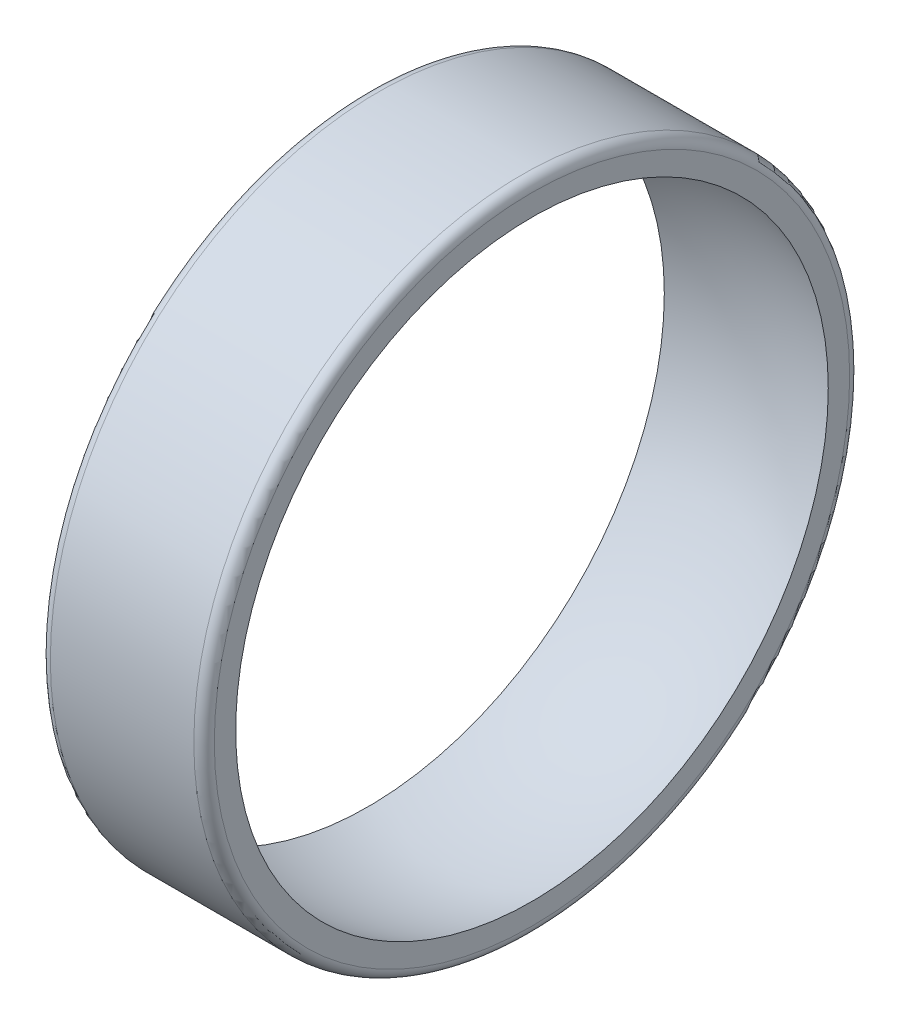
ISO-10303-21;
HEADER;
FILE_DESCRIPTION(('STEP AP214'),'2;1');
FILE_NAME('part.step','',(''),(''),'','','');
FILE_SCHEMA(('AUTOMOTIVE_DESIGN { 1 0 10303 214 1 1 1 1 }'));
ENDSEC;
DATA;
#1=APPLICATION_CONTEXT('core data for automotive mechanical design processes');
#2=APPLICATION_PROTOCOL_DEFINITION('international standard','automotive_design',2000,#1);
#3=PRODUCT_CONTEXT('',#1,'mechanical');
#4=PRODUCT('Part','Part','',(#3));
#5=PRODUCT_RELATED_PRODUCT_CATEGORY('part','',(#4));
#6=PRODUCT_DEFINITION_FORMATION('','',#4);
#7=PRODUCT_DEFINITION_CONTEXT('part definition',#1,'design');
#8=PRODUCT_DEFINITION('design','',#6,#7);
#9=PRODUCT_DEFINITION_SHAPE('','',#8);
#10=(LENGTH_UNIT() NAMED_UNIT(*) SI_UNIT(.MILLI.,.METRE.));
#11=(NAMED_UNIT(*) PLANE_ANGLE_UNIT() SI_UNIT($,.RADIAN.));
#12=(NAMED_UNIT(*) SI_UNIT($,.STERADIAN.) SOLID_ANGLE_UNIT());
#13=UNCERTAINTY_MEASURE_WITH_UNIT(LENGTH_MEASURE(1.E-05),#10,'distance_accuracy_value','');
#14=(GEOMETRIC_REPRESENTATION_CONTEXT(3) GLOBAL_UNCERTAINTY_ASSIGNED_CONTEXT((#13)) GLOBAL_UNIT_ASSIGNED_CONTEXT((#10,
#11,#12)) REPRESENTATION_CONTEXT('',''));
#15=CARTESIAN_POINT('',(0.,0.,0.));
#16=DIRECTION('',(0.,0.,1.));
#17=DIRECTION('',(1.,0.,0.));
#18=AXIS2_PLACEMENT_3D('',#15,#16,#17);
#19=CARTESIAN_POINT('',(2.5,0.,0.));
#20=DIRECTION('',(-1.,0.,0.));
#21=DIRECTION('',(0.,0.,1.));
#22=AXIS2_PLACEMENT_3D('',#19,#20,#21);
#23=TOROIDAL_SURFACE('',#22,77.5,2.5);
#24=CARTESIAN_POINT('',(0.,0.,0.));
#25=DIRECTION('',(-1.,0.,0.));
#26=DIRECTION('',(0.,0.,1.));
#27=AXIS2_PLACEMENT_3D('',#24,#25,#26);
#28=CIRCLE('',#27,77.5);
#29=CARTESIAN_POINT('',(0.,0.,77.5));
#30=VERTEX_POINT('',#29);
#31=EDGE_CURVE('E10',#30,#30,#28,.T.);
#32=ORIENTED_EDGE('',*,*,#31,.F.);
#33=EDGE_LOOP('',(#32));
#34=FACE_BOUND('',#33,.T.);
#35=CARTESIAN_POINT('',(2.5,0.,0.));
#36=DIRECTION('',(-1.,0.,0.));
#37=DIRECTION('',(0.,0.,1.));
#38=AXIS2_PLACEMENT_3D('',#35,#36,#37);
#39=CIRCLE('',#38,80.);
#40=CARTESIAN_POINT('',(2.5,0.,80.));
#41=VERTEX_POINT('',#40);
#42=EDGE_CURVE('E51',#41,#41,#39,.T.);
#43=ORIENTED_EDGE('',*,*,#42,.T.);
#44=EDGE_LOOP('',(#43));
#45=FACE_BOUND('',#44,.T.);
#46=ADVANCED_FACE('F29',(#34,#45),#23,.T.);
#47=CARTESIAN_POINT('',(0.,0.,-72.2841614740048));
#48=DIRECTION('',(1.,0.,0.));
#49=DIRECTION('',(0.,0.,-1.));
#50=AXIS2_PLACEMENT_3D('',#47,#48,#49);
#51=PLANE('',#50);
#52=CARTESIAN_POINT('',(0.,0.,0.));
#53=DIRECTION('',(-1.,0.,0.));
#54=DIRECTION('',(0.,0.,1.));
#55=AXIS2_PLACEMENT_3D('',#52,#53,#54);
#56=CIRCLE('',#55,72.2841614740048);
#57=CARTESIAN_POINT('',(0.,0.,-72.2841614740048));
#58=VERTEX_POINT('',#57);
#59=EDGE_CURVE('E35',#58,#58,#56,.T.);
#60=ORIENTED_EDGE('',*,*,#59,.F.);
#61=EDGE_LOOP('',(#60));
#62=FACE_BOUND('',#61,.T.);
#63=ORIENTED_EDGE('',*,*,#31,.T.);
#64=EDGE_LOOP('',(#63));
#65=FACE_BOUND('',#64,.T.);
#66=ADVANCED_FACE('F76',(#62,#65),#51,.F.);
#67=CARTESIAN_POINT('',(20.,0.,0.));
#68=DIRECTION('',(-1.,0.,0.));
#69=DIRECTION('',(0.,0.,-1.));
#70=AXIS2_PLACEMENT_3D('',#67,#68,#69);
#71=SPHERICAL_SURFACE('',#70,75.);
#72=CARTESIAN_POINT('',(40.,0.,0.));
#73=DIRECTION('',(-1.,0.,0.));
#74=DIRECTION('',(0.,0.,1.));
#75=AXIS2_PLACEMENT_3D('',#72,#73,#74);
#76=CIRCLE('',#75,72.2841614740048);
#77=CARTESIAN_POINT('',(40.,0.,-72.2841614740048));
#78=VERTEX_POINT('',#77);
#79=EDGE_CURVE('E39',#78,#78,#76,.T.);
#80=CARTESIAN_POINT('',(40.,0.,-72.2841614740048));
#81=CARTESIAN_POINT('',(39.5935028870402,0.,-72.3966338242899));
#82=CARTESIAN_POINT('',(39.1860568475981,0.,-72.5056765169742));
#83=CARTESIAN_POINT('',(38.3693832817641,0.,-72.716873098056));
#84=CARTESIAN_POINT('',(37.9601557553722,0.,-72.8190269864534));
#85=CARTESIAN_POINT('',(37.1400355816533,0.,-73.0164164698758));
#86=CARTESIAN_POINT('',(36.7291429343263,0.,-73.1116520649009));
#87=CARTESIAN_POINT('',(35.9058094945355,0.,-73.2951779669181));
#88=CARTESIAN_POINT('',(35.4933687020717,0.,-73.3834682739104));
#89=CARTESIAN_POINT('',(34.6670563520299,0.,-73.5530784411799));
#90=CARTESIAN_POINT('',(34.2531847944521,0.,-73.6343983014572));
#91=CARTESIAN_POINT('',(33.4241287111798,0.,-73.7900444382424));
#92=CARTESIAN_POINT('',(33.0089441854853,0.,-73.8643707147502));
#93=CARTESIAN_POINT('',(32.177380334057,0.,-74.0060085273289));
#94=CARTESIAN_POINT('',(31.7610010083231,0.,-74.0733200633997));
#95=CARTESIAN_POINT('',(30.9271660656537,0.,-74.2009092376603));
#96=CARTESIAN_POINT('',(30.5097104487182,0.,-74.26118687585));
#97=CARTESIAN_POINT('',(29.6738417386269,0.,-74.3746910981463));
#98=CARTESIAN_POINT('',(29.255428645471,0.,-74.427917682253));
#99=CARTESIAN_POINT('',(28.4177640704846,0.,-74.5273046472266));
#100=CARTESIAN_POINT('',(27.998512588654,0.,-74.5734650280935));
#101=CARTESIAN_POINT('',(27.15929056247,0.,-74.6587064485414));
#102=CARTESIAN_POINT('',(26.7393200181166,0.,-74.6977874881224));
#103=CARTESIAN_POINT('',(25.8987793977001,0.,-74.7688591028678));
#104=CARTESIAN_POINT('',(25.4782093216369,0.,-74.8008496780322));
#105=CARTESIAN_POINT('',(24.6365893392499,0.,-74.8577312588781));
#106=CARTESIAN_POINT('',(24.215539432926,0.,-74.8826222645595));
#107=CARTESIAN_POINT('',(23.3730796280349,0.,-74.9252976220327));
#108=CARTESIAN_POINT('',(22.9516697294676,0.,-74.9430819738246));
#109=CARTESIAN_POINT('',(22.1086098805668,0.,-74.9715389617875));
#110=CARTESIAN_POINT('',(21.6869599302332,0.,-74.9822115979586));
#111=CARTESIAN_POINT('',(20.8435399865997,0.,-74.9964421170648));
#112=CARTESIAN_POINT('',(20.4217699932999,0.,-75.));
#113=CARTESIAN_POINT('',(19.5782300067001,0.,-75.));
#114=CARTESIAN_POINT('',(19.1564600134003,0.,-74.9964421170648));
#115=CARTESIAN_POINT('',(18.3130400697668,0.,-74.9822115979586));
#116=CARTESIAN_POINT('',(17.8913901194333,0.,-74.9715389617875));
#117=CARTESIAN_POINT('',(17.0483302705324,0.,-74.9430819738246));
#118=CARTESIAN_POINT('',(16.6269203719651,0.,-74.9252976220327));
#119=CARTESIAN_POINT('',(15.784460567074,0.,-74.8826222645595));
#120=CARTESIAN_POINT('',(15.3634106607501,0.,-74.8577312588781));
#121=CARTESIAN_POINT('',(14.5217906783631,0.,-74.8008496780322));
#122=CARTESIAN_POINT('',(14.1012206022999,0.,-74.7688591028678));
#123=CARTESIAN_POINT('',(13.2606799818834,0.,-74.6977874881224));
#124=CARTESIAN_POINT('',(12.84070943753,0.,-74.6587064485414));
#125=CARTESIAN_POINT('',(12.001487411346,0.,-74.5734650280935));
#126=CARTESIAN_POINT('',(11.5822359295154,0.,-74.5273046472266));
#127=CARTESIAN_POINT('',(10.744571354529,0.,-74.427917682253));
#128=CARTESIAN_POINT('',(10.3261582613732,0.,-74.3746910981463));
#129=CARTESIAN_POINT('',(9.49028955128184,0.,-74.26118687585));
#130=CARTESIAN_POINT('',(9.07283393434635,0.,-74.2009092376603));
#131=CARTESIAN_POINT('',(8.23899899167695,0.,-74.0733200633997));
#132=CARTESIAN_POINT('',(7.82261966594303,0.,-74.0060085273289));
#133=CARTESIAN_POINT('',(6.99105581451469,0.,-73.8643707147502));
#134=CARTESIAN_POINT('',(6.57587128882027,0.,-73.7900444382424));
#135=CARTESIAN_POINT('',(5.74681520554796,0.,-73.6343983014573));
#136=CARTESIAN_POINT('',(5.33294364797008,0.,-73.5530784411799));
#137=CARTESIAN_POINT('',(4.50663129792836,0.,-73.3834682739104));
#138=CARTESIAN_POINT('',(4.09419050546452,0.,-73.2951779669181));
#139=CARTESIAN_POINT('',(3.27085706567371,0.,-73.1116520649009));
#140=CARTESIAN_POINT('',(2.85996441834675,0.,-73.0164164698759));
#141=CARTESIAN_POINT('',(2.03984424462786,0.,-72.8190269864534));
#142=CARTESIAN_POINT('',(1.63061671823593,0.,-72.716873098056));
#143=CARTESIAN_POINT('',(0.813943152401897,0.,-72.5056765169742));
#144=CARTESIAN_POINT('',(0.406497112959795,0.,-72.3966338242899));
#145=CARTESIAN_POINT('',(0.,0.,-72.2841614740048));
#146=B_SPLINE_CURVE_WITH_KNOTS('',3,(#80,#81,#82,#83,#84,#85,#86,#87,#88,#89,#90,#91,#92,#93,
#94,#95,#96,#97,#98,#99,#100,#101,#102,#103,#104,#105,#106,#107,#108,#109,#110,#111,#112,#113,
#114,#115,#116,#117,#118,#119,#120,#121,#122,#123,#124,#125,#126,#127,#128,#129,#130,#131,#132,
#133,#134,#135,#136,#137,#138,#139,#140,#141,#142,#143,#144,#145),.UNSPECIFIED.,.F.,.F.,(4,2,2,
2,2,2,2,2,2,2,2,2,2,2,2,2,2,2,2,2,2,2,2,2,2,2,2,2,2,2,2,2,4),(0.,1.26529497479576,
2.53058994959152,3.79588492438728,5.06117989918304,6.32647487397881,7.59176984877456,
8.85706482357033,10.1223597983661,11.3876547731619,12.6529497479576,13.9182447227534,
15.1835396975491,16.4488346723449,17.7141296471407,18.9794246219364,20.2447195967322,
21.5100145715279,22.7753095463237,24.0406045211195,25.3058994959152,26.571194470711,
27.8364894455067,29.1017844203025,30.3670793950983,31.632374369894,32.8976693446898,
34.1629643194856,35.4282592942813,36.6935542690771,37.9588492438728,39.2241442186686,
40.4894391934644),.UNSPECIFIED.);
#147=EDGE_CURVE('BSEAM71',#78,#58,#146,.T.);
#148=ORIENTED_EDGE('',*,*,#79,.F.);
#149=ORIENTED_EDGE('',*,*,#59,.T.);
#150=ORIENTED_EDGE('',*,*,#147,.T.);
#151=ORIENTED_EDGE('',*,*,#147,.F.);
#152=EDGE_LOOP('',(#148,#150,#149,#151));
#153=FACE_BOUND('',#152,.T.);
#154=ADVANCED_FACE('F71',(#153),#71,.F.);
#155=CARTESIAN_POINT('',(40.,0.,-72.2841614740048));
#156=DIRECTION('',(-1.,0.,0.));
#157=DIRECTION('',(0.,0.,1.));
#158=AXIS2_PLACEMENT_3D('',#155,#156,#157);
#159=PLANE('',#158);
#160=CARTESIAN_POINT('',(40.,0.,0.));
#161=DIRECTION('',(-1.,0.,0.));
#162=DIRECTION('',(0.,0.,1.));
#163=AXIS2_PLACEMENT_3D('',#160,#161,#162);
#164=CIRCLE('',#163,77.5);
#165=CARTESIAN_POINT('',(40.,0.,77.5));
#166=VERTEX_POINT('',#165);
#167=EDGE_CURVE('E43',#166,#166,#164,.T.);
#168=ORIENTED_EDGE('',*,*,#167,.F.);
#169=EDGE_LOOP('',(#168));
#170=FACE_BOUND('',#169,.T.);
#171=ORIENTED_EDGE('',*,*,#79,.T.);
#172=EDGE_LOOP('',(#171));
#173=FACE_BOUND('',#172,.T.);
#174=ADVANCED_FACE('F65',(#170,#173),#159,.F.);
#175=CARTESIAN_POINT('',(37.5,0.,0.));
#176=DIRECTION('',(-1.,0.,0.));
#177=DIRECTION('',(0.,0.,1.));
#178=AXIS2_PLACEMENT_3D('',#175,#176,#177);
#179=TOROIDAL_SURFACE('',#178,77.5,2.5);
#180=CARTESIAN_POINT('',(37.5,0.,0.));
#181=DIRECTION('',(-1.,0.,0.));
#182=DIRECTION('',(0.,0.,1.));
#183=AXIS2_PLACEMENT_3D('',#180,#181,#182);
#184=CIRCLE('',#183,80.);
#185=CARTESIAN_POINT('',(37.5,0.,80.));
#186=VERTEX_POINT('',#185);
#187=EDGE_CURVE('E48',#186,#186,#184,.T.);
#188=ORIENTED_EDGE('',*,*,#187,.F.);
#189=EDGE_LOOP('',(#188));
#190=FACE_BOUND('',#189,.T.);
#191=ORIENTED_EDGE('',*,*,#167,.T.);
#192=EDGE_LOOP('',(#191));
#193=FACE_BOUND('',#192,.T.);
#194=ADVANCED_FACE('F59',(#190,#193),#179,.T.);
#195=CARTESIAN_POINT('',(0.,0.,0.));
#196=DIRECTION('',(-1.,0.,0.));
#197=DIRECTION('',(0.,0.,1.));
#198=AXIS2_PLACEMENT_3D('',#195,#196,#197);
#199=CYLINDRICAL_SURFACE('',#198,80.);
#200=ORIENTED_EDGE('',*,*,#42,.F.);
#201=EDGE_LOOP('',(#200));
#202=FACE_BOUND('',#201,.T.);
#203=ORIENTED_EDGE('',*,*,#187,.T.);
#204=EDGE_LOOP('',(#203));
#205=FACE_BOUND('',#204,.T.);
#206=ADVANCED_FACE('F56',(#202,#205),#199,.T.);
#207=CLOSED_SHELL('',(#46,#66,#154,#174,#194,#206));
#208=MANIFOLD_SOLID_BREP('B2',#207);
#209=ADVANCED_BREP_SHAPE_REPRESENTATION('',(#18,#208),#14);
#210=SHAPE_DEFINITION_REPRESENTATION(#9,#209);
ENDSEC;
END-ISO-10303-21;
